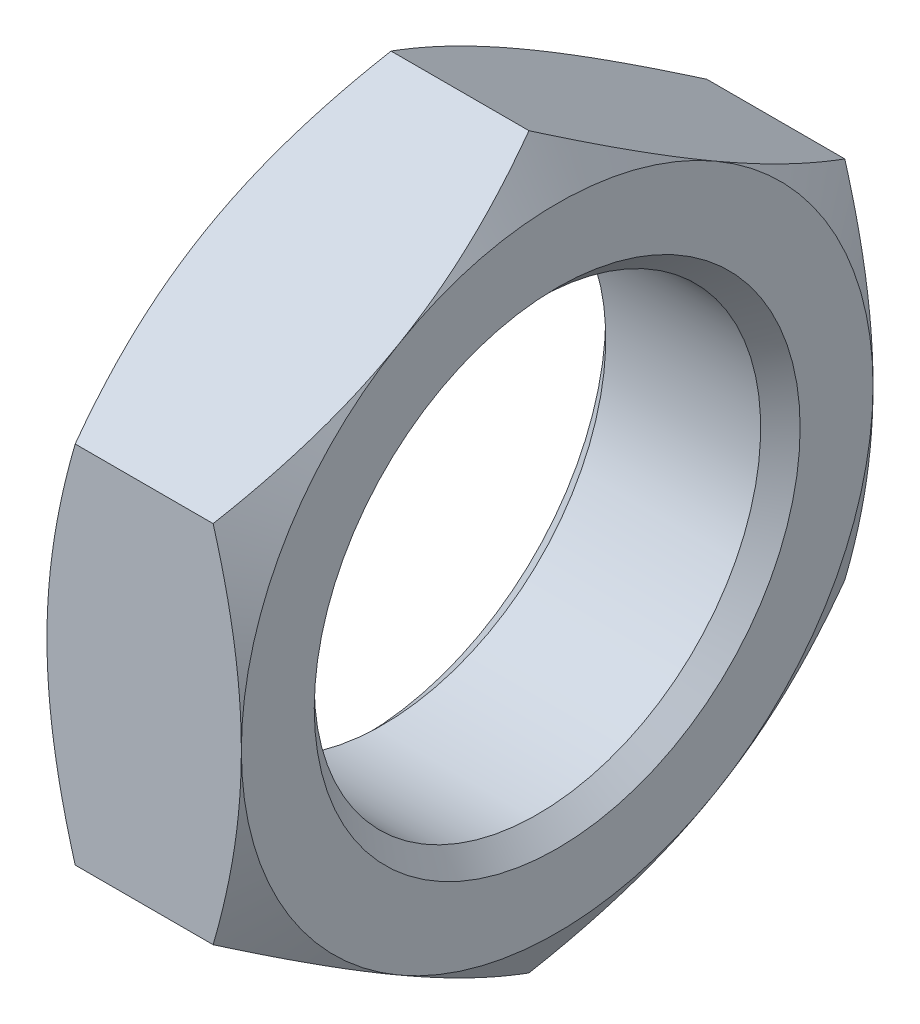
ISO-10303-21;
HEADER;
FILE_DESCRIPTION(('STEP AP214'),'2;1');
FILE_NAME('part.step','',(''),(''),'','','');
FILE_SCHEMA(('AUTOMOTIVE_DESIGN { 1 0 10303 214 1 1 1 1 }'));
ENDSEC;
DATA;
#1=APPLICATION_CONTEXT('core data for automotive mechanical design processes');
#2=APPLICATION_PROTOCOL_DEFINITION('international standard','automotive_design',2000,#1);
#3=PRODUCT_CONTEXT('',#1,'mechanical');
#4=PRODUCT('Part','Part','',(#3));
#5=PRODUCT_RELATED_PRODUCT_CATEGORY('part','',(#4));
#6=PRODUCT_DEFINITION_FORMATION('','',#4);
#7=PRODUCT_DEFINITION_CONTEXT('part definition',#1,'design');
#8=PRODUCT_DEFINITION('design','',#6,#7);
#9=PRODUCT_DEFINITION_SHAPE('','',#8);
#10=(LENGTH_UNIT() NAMED_UNIT(*) SI_UNIT(.MILLI.,.METRE.));
#11=(NAMED_UNIT(*) PLANE_ANGLE_UNIT() SI_UNIT($,.RADIAN.));
#12=(NAMED_UNIT(*) SI_UNIT($,.STERADIAN.) SOLID_ANGLE_UNIT());
#13=UNCERTAINTY_MEASURE_WITH_UNIT(LENGTH_MEASURE(1.E-05),#10,'distance_accuracy_value','');
#14=(GEOMETRIC_REPRESENTATION_CONTEXT(3) GLOBAL_UNCERTAINTY_ASSIGNED_CONTEXT((#13)) GLOBAL_UNIT_ASSIGNED_CONTEXT((#10,
#11,#12)) REPRESENTATION_CONTEXT('',''));
#15=CARTESIAN_POINT('',(0.,0.,0.));
#16=DIRECTION('',(0.,0.,1.));
#17=DIRECTION('',(1.,0.,0.));
#18=AXIS2_PLACEMENT_3D('',#15,#16,#17);
#19=CARTESIAN_POINT('',(1.50111069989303,0.,0.));
#20=DIRECTION('',(1.,0.,0.));
#21=DIRECTION('',(0.,0.,-1.));
#22=AXIS2_PLACEMENT_3D('',#19,#20,#21);
#23=CONICAL_SURFACE('',#22,15.6,1.0471975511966);
#24=CARTESIAN_POINT('',(1.16117983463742,-7.5054380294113,-13.0002));
#25=CARTESIAN_POINT('',(1.06594073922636,-7.6704072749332,-12.7144648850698));
#26=CARTESIAN_POINT('',(0.975023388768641,-7.83601998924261,-12.4276152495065));
#27=CARTESIAN_POINT('',(0.80303347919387,-8.16857343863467,-11.8516157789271));
#28=CARTESIAN_POINT('',(0.721964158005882,-8.33551459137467,-11.5624652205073));
#29=CARTESIAN_POINT('',(0.570760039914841,-8.67104755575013,-10.9813050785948));
#30=CARTESIAN_POINT('',(0.500651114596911,-8.83964230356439,-10.6892904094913));
#31=CARTESIAN_POINT('',(0.372873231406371,-9.17800333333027,-10.1032319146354));
#32=CARTESIAN_POINT('',(0.315203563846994,-9.34776954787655,-9.80918820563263));
#33=CARTESIAN_POINT('',(0.214757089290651,-9.68412343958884,-9.22660617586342));
#34=CARTESIAN_POINT('',(0.171647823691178,-9.85068614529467,-8.93811110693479));
#35=CARTESIAN_POINT('',(0.0993629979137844,-10.184574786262,-8.35979901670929));
#36=CARTESIAN_POINT('',(0.0701877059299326,-10.3519007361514,-8.06998197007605));
#37=CARTESIAN_POINT('',(0.0265074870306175,-10.6868337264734,-7.48986101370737));
#38=CARTESIAN_POINT('',(0.0119851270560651,-10.8544401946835,-7.19955809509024));
#39=CARTESIAN_POINT('',(-0.00207691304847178,-11.1898078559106,-6.6186842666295));
#40=CARTESIAN_POINT('',(-0.00161705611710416,-11.3575690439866,-6.32811336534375));
#41=CARTESIAN_POINT('',(0.0132389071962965,-11.6711983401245,-5.78489148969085));
#42=CARTESIAN_POINT('',(0.025822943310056,-11.8170887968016,-5.53220180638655));
#43=CARTESIAN_POINT('',(0.0620843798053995,-12.1085341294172,-5.02740368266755));
#44=CARTESIAN_POINT('',(0.0857625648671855,-12.2540889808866,-4.77529528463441));
#45=CARTESIAN_POINT('',(0.143799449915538,-12.5447840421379,-4.27179666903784));
#46=CARTESIAN_POINT('',(0.178166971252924,-12.6899238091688,-4.02040721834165));
#47=CARTESIAN_POINT('',(0.256979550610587,-12.9795228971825,-3.51880688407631));
#48=CARTESIAN_POINT('',(0.301425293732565,-13.1239821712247,-3.2685960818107));
#49=CARTESIAN_POINT('',(0.451003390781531,-13.5624963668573,-2.50906721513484));
#50=CARTESIAN_POINT('',(0.571050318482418,-13.8552814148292,-2.00194863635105));
#51=CARTESIAN_POINT('',(0.843507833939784,-14.4364856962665,-0.995273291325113));
#52=CARTESIAN_POINT('',(0.995854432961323,-14.724912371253,-0.495703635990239));
#53=CARTESIAN_POINT('',(1.16117983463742,-15.0112224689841,0.00019999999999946));
#54=B_SPLINE_CURVE_WITH_KNOTS('',3,(#24,#25,#26,#27,#28,#29,#30,#31,#32,#33,#34,#35,#36,#37,#38,
#39,#40,#41,#42,#43,#44,#45,#46,#47,#48,#49,#50,#51,#52,#53),.UNSPECIFIED.,.F.,.F.,(4,2,2,2,2,2,
2,2,2,2,2,2,2,2,4),(0.,1.03025461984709,2.06084706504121,3.09383660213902,4.12676718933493,
5.13420251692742,6.14165723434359,7.14791193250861,8.15413553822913,9.03008081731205,
9.90608806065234,10.7828201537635,11.6596118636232,13.4517531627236,15.240376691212),.UNSPECIFIED.);
#55=CARTESIAN_POINT('',(0.,-11.2583302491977,-6.5));
#56=VERTEX_POINT('',#55);
#57=CARTESIAN_POINT('',(1.16111316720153,-15.0111069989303,0.));
#58=VERTEX_POINT('',#57);
#59=EDGE_CURVE('E274',#56,#58,#54,.T.);
#60=ORIENTED_EDGE('',*,*,#59,.T.);
#61=CARTESIAN_POINT('',(1.16117983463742,-15.0112224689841,-0.000199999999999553));
#62=CARTESIAN_POINT('',(1.06594073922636,-14.8462532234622,0.285535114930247));
#63=CARTESIAN_POINT('',(0.975023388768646,-14.6806405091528,0.572384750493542));
#64=CARTESIAN_POINT('',(0.803033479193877,-14.3480870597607,1.14838422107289));
#65=CARTESIAN_POINT('',(0.72196415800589,-14.1811459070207,1.43753477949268));
#66=CARTESIAN_POINT('',(0.570760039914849,-13.8456129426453,2.01869492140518));
#67=CARTESIAN_POINT('',(0.500651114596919,-13.677018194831,2.31070959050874));
#68=CARTESIAN_POINT('',(0.37287323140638,-13.3386571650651,2.89676808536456));
#69=CARTESIAN_POINT('',(0.315203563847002,-13.1688909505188,3.19081179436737));
#70=CARTESIAN_POINT('',(0.21475708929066,-12.8325370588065,3.77339382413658));
#71=CARTESIAN_POINT('',(0.171647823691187,-12.6659743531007,4.06188889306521));
#72=CARTESIAN_POINT('',(0.0993629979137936,-12.3320857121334,4.64020098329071));
#73=CARTESIAN_POINT('',(0.0701877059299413,-12.164759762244,4.93001802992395));
#74=CARTESIAN_POINT('',(0.0265074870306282,-11.829826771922,5.51013898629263));
#75=CARTESIAN_POINT('',(0.0119851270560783,-11.6622203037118,5.80044190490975));
#76=CARTESIAN_POINT('',(-0.00207691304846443,-11.3268526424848,6.3813157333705));
#77=CARTESIAN_POINT('',(-0.00161705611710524,-11.1590914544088,6.67188663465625));
#78=CARTESIAN_POINT('',(0.0132389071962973,-10.8454621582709,7.21510851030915));
#79=CARTESIAN_POINT('',(0.0258229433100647,-10.6995717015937,7.46779819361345));
#80=CARTESIAN_POINT('',(0.0620843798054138,-10.4081263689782,7.97259631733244));
#81=CARTESIAN_POINT('',(0.0857625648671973,-10.2625715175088,8.22470471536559));
#82=CARTESIAN_POINT('',(0.143799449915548,-9.97187645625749,8.72820333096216));
#83=CARTESIAN_POINT('',(0.178166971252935,-9.82673668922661,8.97959278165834));
#84=CARTESIAN_POINT('',(0.256979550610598,-9.5371376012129,9.48119311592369));
#85=CARTESIAN_POINT('',(0.301425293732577,-9.3926783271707,9.73140391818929));
#86=CARTESIAN_POINT('',(0.451003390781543,-8.9541641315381,10.4909327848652));
#87=CARTESIAN_POINT('',(0.571050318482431,-8.66137908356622,10.998051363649));
#88=CARTESIAN_POINT('',(0.843507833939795,-8.08017480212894,12.0047267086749));
#89=CARTESIAN_POINT('',(0.99585443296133,-7.79174812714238,12.5042963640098));
#90=CARTESIAN_POINT('',(1.16117983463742,-7.5054380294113,13.0002));
#91=B_SPLINE_CURVE_WITH_KNOTS('',3,(#61,#62,#63,#64,#65,#66,#67,#68,#69,#70,#71,#72,#73,#74,#75,
#76,#77,#78,#79,#80,#81,#82,#83,#84,#85,#86,#87,#88,#89,#90),.UNSPECIFIED.,.F.,.F.,(4,2,2,2,2,2,
2,2,2,2,2,2,2,2,4),(0.,1.03025461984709,2.0608470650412,3.09383660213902,4.12676718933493,
5.13420251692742,6.14165723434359,7.14791193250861,8.15413553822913,9.03008081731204,
9.90608806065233,10.7828201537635,11.6596118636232,13.4517531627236,15.240376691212),.UNSPECIFIED.);
#92=CARTESIAN_POINT('',(0.,-11.2583302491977,6.5));
#93=VERTEX_POINT('',#92);
#94=EDGE_CURVE('E222',#58,#93,#91,.T.);
#95=ORIENTED_EDGE('',*,*,#94,.T.);
#96=CARTESIAN_POINT('',(0.,0.,0.));
#97=DIRECTION('',(-1.,0.,0.));
#98=DIRECTION('',(0.,0.,1.));
#99=AXIS2_PLACEMENT_3D('',#96,#97,#98);
#100=CIRCLE('',#99,13.);
#101=EDGE_CURVE('E252',#56,#93,#100,.T.);
#102=ORIENTED_EDGE('',*,*,#101,.F.);
#103=EDGE_LOOP('',(#60,#95,#102));
#104=FACE_BOUND('',#103,.T.);
#105=ADVANCED_FACE('F16',(#104),#23,.T.);
#106=CARTESIAN_POINT('',(0.,0.,13.));
#107=VERTEX_POINT('',#106);
#108=EDGE_CURVE('E25',#93,#107,#100,.T.);
#109=ORIENTED_EDGE('',*,*,#108,.F.);
#110=CARTESIAN_POINT('',(1.16111316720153,-7.50555349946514,13.));
#111=VERTEX_POINT('',#110);
#112=EDGE_CURVE('E223',#93,#111,#91,.T.);
#113=ORIENTED_EDGE('',*,*,#112,.T.);
#114=CARTESIAN_POINT('',(6.24367003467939,-19.9530309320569,13.));
#115=CARTESIAN_POINT('',(6.10675951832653,-19.6699984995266,13.));
#116=CARTESIAN_POINT('',(5.97054766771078,-19.3866282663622,13.));
#117=CARTESIAN_POINT('',(5.69967996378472,-18.819141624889,13.));
#118=CARTESIAN_POINT('',(5.56502412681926,-18.5350252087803,13.));
#119=CARTESIAN_POINT('',(5.16359177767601,-17.6813722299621,13.));
#120=CARTESIAN_POINT('',(4.89939263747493,-17.1106189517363,13.));
#121=CARTESIAN_POINT('',(4.37803777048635,-15.9620155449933,13.));
#122=CARTESIAN_POINT('',(4.12093009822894,-15.3841435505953,13.));
#123=CARTESIAN_POINT('',(3.61751387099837,-14.223730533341,13.));
#124=CARTESIAN_POINT('',(3.37120479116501,-13.6411897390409,13.));
#125=CARTESIAN_POINT('',(2.884892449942,-12.4525278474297,13.));
#126=CARTESIAN_POINT('',(2.64531468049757,-11.8462317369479,13.));
#127=CARTESIAN_POINT('',(2.18479905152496,-10.626465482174,13.));
#128=CARTESIAN_POINT('',(1.96386331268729,-10.0129945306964,13.));
#129=CARTESIAN_POINT('',(1.54658767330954,-8.77914030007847,13.));
#130=CARTESIAN_POINT('',(1.35019612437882,-8.158774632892,13.));
#131=CARTESIAN_POINT('',(0.988437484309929,-6.90908844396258,13.));
#132=CARTESIAN_POINT('',(0.823060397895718,-6.2797708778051,13.));
#133=CARTESIAN_POINT('',(0.604789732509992,-5.33071748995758,13.));
#134=CARTESIAN_POINT('',(0.53713702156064,-5.01435400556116,13.));
#135=CARTESIAN_POINT('',(0.412589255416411,-4.37950550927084,13.));
#136=CARTESIAN_POINT('',(0.355693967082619,-4.06102054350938,13.));
#137=CARTESIAN_POINT('',(0.253677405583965,-3.42216285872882,13.));
#138=CARTESIAN_POINT('',(0.208556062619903,-3.1017901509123,13.));
#139=CARTESIAN_POINT('',(0.13099500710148,-2.45951450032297,13.));
#140=CARTESIAN_POINT('',(0.0985548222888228,-2.1376116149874,13.));
#141=CARTESIAN_POINT('',(0.0473958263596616,-1.49683558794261,13.));
#142=CARTESIAN_POINT('',(0.0285075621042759,-1.17797605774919,13.));
#143=CARTESIAN_POINT('',(0.00421658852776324,-0.539745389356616,13.));
#144=CARTESIAN_POINT('',(-0.00118633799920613,-0.220374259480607,13.));
#145=CARTESIAN_POINT('',(0.00162133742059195,0.418312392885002,13.));
#146=CARTESIAN_POINT('',(0.00983206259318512,0.737627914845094,13.));
#147=CARTESIAN_POINT('',(0.0396705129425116,1.37563550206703,13.));
#148=CARTESIAN_POINT('',(0.0612988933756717,1.69432753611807,13.));
#149=CARTESIAN_POINT('',(0.129522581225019,2.46666381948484,13.));
#150=CARTESIAN_POINT('',(0.18284007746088,2.91972422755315,13.));
#151=CARTESIAN_POINT('',(0.313637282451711,3.8223465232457,13.));
#152=CARTESIAN_POINT('',(0.391120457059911,4.27190789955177,13.));
#153=CARTESIAN_POINT('',(0.56749215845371,5.16715105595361,13.));
#154=CARTESIAN_POINT('',(0.666398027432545,5.61282938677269,13.));
#155=CARTESIAN_POINT('',(0.882609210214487,6.49964973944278,13.));
#156=CARTESIAN_POINT('',(0.999914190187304,6.94079184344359,13.));
#157=CARTESIAN_POINT('',(1.25281090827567,7.82808644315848,13.));
#158=CARTESIAN_POINT('',(1.38874298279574,8.27414126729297,13.));
#159=CARTESIAN_POINT('',(1.6742012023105,9.16185536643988,13.));
#160=CARTESIAN_POINT('',(1.82372743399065,9.60351461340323,13.));
#161=CARTESIAN_POINT('',(2.13403960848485,10.4826634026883,13.));
#162=CARTESIAN_POINT('',(2.29482150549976,10.9201543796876,13.));
#163=CARTESIAN_POINT('',(2.62579789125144,11.7915419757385,13.));
#164=CARTESIAN_POINT('',(2.79599229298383,12.2254386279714,13.));
#165=CARTESIAN_POINT('',(3.19272444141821,13.2104671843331,13.));
#166=CARTESIAN_POINT('',(3.42175285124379,13.7605941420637,13.));
#167=CARTESIAN_POINT('',(3.89005160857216,14.856483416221,13.));
#168=CARTESIAN_POINT('',(4.12932246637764,15.4022455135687,13.));
#169=CARTESIAN_POINT('',(4.61615654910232,16.4901695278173,13.));
#170=CARTESIAN_POINT('',(4.86372128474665,17.0323307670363,13.));
#171=CARTESIAN_POINT('',(5.36555618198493,18.1135228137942,13.));
#172=CARTESIAN_POINT('',(5.61982622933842,18.6525536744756,13.));
#173=CARTESIAN_POINT('',(6.13412047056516,19.7284871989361,13.));
#174=CARTESIAN_POINT('',(6.39414989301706,20.2653873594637,13.));
#175=CARTESIAN_POINT('',(6.91878563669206,21.3369461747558,13.));
#176=CARTESIAN_POINT('',(7.18339197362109,21.8716048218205,13.));
#177=CARTESIAN_POINT('',(7.71640252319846,22.9389529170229,13.));
#178=CARTESIAN_POINT('',(7.98480632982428,23.4716425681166,13.));
#179=CARTESIAN_POINT('',(8.52484428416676,24.5353827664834,13.));
#180=CARTESIAN_POINT('',(8.7964784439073,25.0664333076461,13.));
#181=CARTESIAN_POINT('',(9.57296546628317,26.5748797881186,13.));
#182=CARTESIAN_POINT('',(10.0811007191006,27.5505861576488,13.));
#183=CARTESIAN_POINT('',(11.1043856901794,29.4983412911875,13.));
#184=CARTESIAN_POINT('',(11.6195356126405,30.4703899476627,13.));
#185=CARTESIAN_POINT('',(12.6541114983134,32.4094614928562,13.));
#186=CARTESIAN_POINT('',(13.1735255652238,33.376490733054,13.));
#187=CARTESIAN_POINT('',(13.9558199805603,34.8252888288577,13.));
#188=CARTESIAN_POINT('',(14.2171074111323,35.3079190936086,13.));
#189=CARTESIAN_POINT('',(14.7406361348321,36.2726610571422,13.));
#190=CARTESIAN_POINT('',(15.0028774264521,36.754772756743,13.));
#191=CARTESIAN_POINT('',(15.265542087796,37.2366537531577,13.));
#192=B_SPLINE_CURVE_WITH_KNOTS('',3,(#114,#115,#116,#117,#118,#119,#120,#121,#122,#123,#124,
#125,#126,#127,#128,#129,#130,#131,#132,#133,#134,#135,#136,#137,#138,#139,#140,#141,#142,#143,
#144,#145,#146,#147,#148,#149,#150,#151,#152,#153,#154,#155,#156,#157,#158,#159,#160,#161,#162,
#163,#164,#165,#166,#167,#168,#169,#170,#171,#172,#173,#174,#175,#176,#177,#178,#179,#180,#181,
#182,#183,#184,#185,#186,#187,#188,#189,#190,#191),.UNSPECIFIED.,.F.,.F.,(4,2,2,2,2,2,2,2,2,2,2,
2,2,2,2,2,2,2,2,2,2,2,2,2,2,2,2,2,2,2,2,2,2,2,2,2,2,2,4),(0.,0.943219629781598,1.88644915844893,
3.7731983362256,5.6705747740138,7.56785888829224,9.52336832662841,11.4790999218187,
13.4306441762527,15.3815584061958,16.3519537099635,17.3223279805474,18.2926964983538,
19.2630288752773,20.2210061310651,21.1789679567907,22.1369384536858,23.0949557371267,
24.4627548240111,25.8307501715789,27.1998571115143,28.5689392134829,29.9676009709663,
31.3662716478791,32.7644421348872,34.1625997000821,35.9501549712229,37.7377994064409,
39.5257712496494,41.3137126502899,43.1033497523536,44.8929929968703,46.682446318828,
48.4719063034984,51.7721421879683,55.0724743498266,58.3655479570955,60.0120063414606,
61.6584621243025),.UNSPECIFIED.);
#193=EDGE_CURVE('E232',#111,#107,#192,.T.);
#194=ORIENTED_EDGE('',*,*,#193,.T.);
#195=EDGE_LOOP('',(#109,#113,#194));
#196=FACE_BOUND('',#195,.T.);
#197=ADVANCED_FACE('F310',(#196),#23,.T.);
#198=CARTESIAN_POINT('',(0.,11.2583302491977,6.5));
#199=VERTEX_POINT('',#198);
#200=EDGE_CURVE('E11',#107,#199,#100,.T.);
#201=ORIENTED_EDGE('',*,*,#200,.F.);
#202=CARTESIAN_POINT('',(1.16111316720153,7.50555349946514,13.));
#203=VERTEX_POINT('',#202);
#204=EDGE_CURVE('E135',#107,#203,#192,.T.);
#205=ORIENTED_EDGE('',*,*,#204,.T.);
#206=CARTESIAN_POINT('',(1.16117983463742,7.5054380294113,13.0002));
#207=CARTESIAN_POINT('',(1.06594073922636,7.6704072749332,12.7144648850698));
#208=CARTESIAN_POINT('',(0.975023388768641,7.83601998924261,12.4276152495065));
#209=CARTESIAN_POINT('',(0.80303347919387,8.16857343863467,11.8516157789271));
#210=CARTESIAN_POINT('',(0.721964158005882,8.33551459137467,11.5624652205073));
#211=CARTESIAN_POINT('',(0.570760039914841,8.67104755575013,10.9813050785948));
#212=CARTESIAN_POINT('',(0.500651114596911,8.83964230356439,10.6892904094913));
#213=CARTESIAN_POINT('',(0.372873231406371,9.17800333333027,10.1032319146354));
#214=CARTESIAN_POINT('',(0.315203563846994,9.34776954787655,9.80918820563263));
#215=CARTESIAN_POINT('',(0.214757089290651,9.68412343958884,9.22660617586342));
#216=CARTESIAN_POINT('',(0.171647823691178,9.85068614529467,8.93811110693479));
#217=CARTESIAN_POINT('',(0.0993629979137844,10.184574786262,8.35979901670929));
#218=CARTESIAN_POINT('',(0.0701877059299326,10.3519007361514,8.06998197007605));
#219=CARTESIAN_POINT('',(0.0265074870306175,10.6868337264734,7.48986101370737));
#220=CARTESIAN_POINT('',(0.0119851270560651,10.8544401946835,7.19955809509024));
#221=CARTESIAN_POINT('',(-0.00207691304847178,11.1898078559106,6.6186842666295));
#222=CARTESIAN_POINT('',(-0.00161705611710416,11.3575690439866,6.32811336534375));
#223=CARTESIAN_POINT('',(0.0132389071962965,11.6711983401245,5.78489148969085));
#224=CARTESIAN_POINT('',(0.025822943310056,11.8170887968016,5.53220180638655));
#225=CARTESIAN_POINT('',(0.0620843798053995,12.1085341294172,5.02740368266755));
#226=CARTESIAN_POINT('',(0.0857625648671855,12.2540889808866,4.77529528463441));
#227=CARTESIAN_POINT('',(0.143799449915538,12.5447840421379,4.27179666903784));
#228=CARTESIAN_POINT('',(0.178166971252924,12.6899238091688,4.02040721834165));
#229=CARTESIAN_POINT('',(0.256979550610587,12.9795228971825,3.51880688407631));
#230=CARTESIAN_POINT('',(0.301425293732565,13.1239821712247,3.2685960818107));
#231=CARTESIAN_POINT('',(0.451003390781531,13.5624963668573,2.50906721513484));
#232=CARTESIAN_POINT('',(0.571050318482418,13.8552814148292,2.00194863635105));
#233=CARTESIAN_POINT('',(0.843507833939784,14.4364856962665,0.995273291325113));
#234=CARTESIAN_POINT('',(0.995854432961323,14.724912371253,0.495703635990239));
#235=CARTESIAN_POINT('',(1.16117983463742,15.0112224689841,-0.00019999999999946));
#236=B_SPLINE_CURVE_WITH_KNOTS('',3,(#206,#207,#208,#209,#210,#211,#212,#213,#214,#215,#216,
#217,#218,#219,#220,#221,#222,#223,#224,#225,#226,#227,#228,#229,#230,#231,#232,#233,#234,#235),
.UNSPECIFIED.,.F.,.F.,(4,2,2,2,2,2,2,2,2,2,2,2,2,2,4),(0.,1.03025461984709,2.06084706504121,
3.09383660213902,4.12676718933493,5.13420251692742,6.14165723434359,7.14791193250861,
8.15413553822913,9.03008081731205,9.90608806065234,10.7828201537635,11.6596118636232,
13.4517531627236,15.240376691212),.UNSPECIFIED.);
#237=EDGE_CURVE('E136',#203,#199,#236,.T.);
#238=ORIENTED_EDGE('',*,*,#237,.T.);
#239=EDGE_LOOP('',(#201,#205,#238));
#240=FACE_BOUND('',#239,.T.);
#241=ADVANCED_FACE('F134',(#240),#23,.T.);
#242=CARTESIAN_POINT('',(6.24367003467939,-19.9530309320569,-13.));
#243=CARTESIAN_POINT('',(6.10675951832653,-19.6699984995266,-13.));
#244=CARTESIAN_POINT('',(5.97054766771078,-19.3866282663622,-13.));
#245=CARTESIAN_POINT('',(5.69967996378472,-18.819141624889,-13.));
#246=CARTESIAN_POINT('',(5.56502412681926,-18.5350252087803,-13.));
#247=CARTESIAN_POINT('',(5.16359177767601,-17.6813722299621,-13.));
#248=CARTESIAN_POINT('',(4.89939263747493,-17.1106189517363,-13.));
#249=CARTESIAN_POINT('',(4.37803777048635,-15.9620155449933,-13.));
#250=CARTESIAN_POINT('',(4.12093009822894,-15.3841435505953,-13.));
#251=CARTESIAN_POINT('',(3.61751387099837,-14.223730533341,-13.));
#252=CARTESIAN_POINT('',(3.37120479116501,-13.6411897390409,-13.));
#253=CARTESIAN_POINT('',(2.884892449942,-12.4525278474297,-13.));
#254=CARTESIAN_POINT('',(2.64531468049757,-11.8462317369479,-13.));
#255=CARTESIAN_POINT('',(2.18479905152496,-10.626465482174,-13.));
#256=CARTESIAN_POINT('',(1.96386331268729,-10.0129945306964,-13.));
#257=CARTESIAN_POINT('',(1.54658767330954,-8.77914030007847,-13.));
#258=CARTESIAN_POINT('',(1.35019612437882,-8.158774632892,-13.));
#259=CARTESIAN_POINT('',(0.988437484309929,-6.90908844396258,-13.));
#260=CARTESIAN_POINT('',(0.823060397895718,-6.2797708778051,-13.));
#261=CARTESIAN_POINT('',(0.604789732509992,-5.33071748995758,-13.));
#262=CARTESIAN_POINT('',(0.53713702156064,-5.01435400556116,-13.));
#263=CARTESIAN_POINT('',(0.412589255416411,-4.37950550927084,-13.));
#264=CARTESIAN_POINT('',(0.355693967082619,-4.06102054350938,-13.));
#265=CARTESIAN_POINT('',(0.253677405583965,-3.42216285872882,-13.));
#266=CARTESIAN_POINT('',(0.208556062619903,-3.1017901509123,-13.));
#267=CARTESIAN_POINT('',(0.13099500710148,-2.45951450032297,-13.));
#268=CARTESIAN_POINT('',(0.0985548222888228,-2.1376116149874,-13.));
#269=CARTESIAN_POINT('',(0.0473958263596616,-1.49683558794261,-13.));
#270=CARTESIAN_POINT('',(0.0285075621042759,-1.17797605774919,-13.));
#271=CARTESIAN_POINT('',(0.00421658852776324,-0.539745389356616,-13.));
#272=CARTESIAN_POINT('',(-0.00118633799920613,-0.220374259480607,-13.));
#273=CARTESIAN_POINT('',(0.00162133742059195,0.418312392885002,-13.));
#274=CARTESIAN_POINT('',(0.00983206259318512,0.737627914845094,-13.));
#275=CARTESIAN_POINT('',(0.0396705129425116,1.37563550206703,-13.));
#276=CARTESIAN_POINT('',(0.0612988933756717,1.69432753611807,-13.));
#277=CARTESIAN_POINT('',(0.129522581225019,2.46666381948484,-13.));
#278=CARTESIAN_POINT('',(0.18284007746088,2.91972422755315,-13.));
#279=CARTESIAN_POINT('',(0.313637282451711,3.8223465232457,-13.));
#280=CARTESIAN_POINT('',(0.391120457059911,4.27190789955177,-13.));
#281=CARTESIAN_POINT('',(0.56749215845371,5.16715105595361,-13.));
#282=CARTESIAN_POINT('',(0.666398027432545,5.61282938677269,-13.));
#283=CARTESIAN_POINT('',(0.882609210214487,6.49964973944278,-13.));
#284=CARTESIAN_POINT('',(0.999914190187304,6.94079184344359,-13.));
#285=CARTESIAN_POINT('',(1.25281090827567,7.82808644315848,-13.));
#286=CARTESIAN_POINT('',(1.38874298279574,8.27414126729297,-13.));
#287=CARTESIAN_POINT('',(1.6742012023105,9.16185536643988,-13.));
#288=CARTESIAN_POINT('',(1.82372743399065,9.60351461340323,-13.));
#289=CARTESIAN_POINT('',(2.13403960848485,10.4826634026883,-13.));
#290=CARTESIAN_POINT('',(2.29482150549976,10.9201543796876,-13.));
#291=CARTESIAN_POINT('',(2.62579789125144,11.7915419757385,-13.));
#292=CARTESIAN_POINT('',(2.79599229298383,12.2254386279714,-13.));
#293=CARTESIAN_POINT('',(3.19272444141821,13.2104671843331,-13.));
#294=CARTESIAN_POINT('',(3.42175285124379,13.7605941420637,-13.));
#295=CARTESIAN_POINT('',(3.89005160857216,14.856483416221,-13.));
#296=CARTESIAN_POINT('',(4.12932246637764,15.4022455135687,-13.));
#297=CARTESIAN_POINT('',(4.61615654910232,16.4901695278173,-13.));
#298=CARTESIAN_POINT('',(4.86372128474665,17.0323307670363,-13.));
#299=CARTESIAN_POINT('',(5.36555618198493,18.1135228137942,-13.));
#300=CARTESIAN_POINT('',(5.61982622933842,18.6525536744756,-13.));
#301=CARTESIAN_POINT('',(6.13412047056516,19.7284871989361,-13.));
#302=CARTESIAN_POINT('',(6.39414989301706,20.2653873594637,-13.));
#303=CARTESIAN_POINT('',(6.91878563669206,21.3369461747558,-13.));
#304=CARTESIAN_POINT('',(7.18339197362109,21.8716048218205,-13.));
#305=CARTESIAN_POINT('',(7.71640252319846,22.9389529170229,-13.));
#306=CARTESIAN_POINT('',(7.98480632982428,23.4716425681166,-13.));
#307=CARTESIAN_POINT('',(8.52484428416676,24.5353827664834,-13.));
#308=CARTESIAN_POINT('',(8.7964784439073,25.0664333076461,-13.));
#309=CARTESIAN_POINT('',(9.57296546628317,26.5748797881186,-13.));
#310=CARTESIAN_POINT('',(10.0811007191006,27.5505861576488,-13.));
#311=CARTESIAN_POINT('',(11.1043856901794,29.4983412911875,-13.));
#312=CARTESIAN_POINT('',(11.6195356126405,30.4703899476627,-13.));
#313=CARTESIAN_POINT('',(12.6541114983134,32.4094614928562,-13.));
#314=CARTESIAN_POINT('',(13.1735255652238,33.376490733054,-13.));
#315=CARTESIAN_POINT('',(13.9558199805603,34.8252888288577,-13.));
#316=CARTESIAN_POINT('',(14.2171074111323,35.3079190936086,-13.));
#317=CARTESIAN_POINT('',(14.7406361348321,36.2726610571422,-13.));
#318=CARTESIAN_POINT('',(15.0028774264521,36.754772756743,-13.));
#319=CARTESIAN_POINT('',(15.265542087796,37.2366537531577,-13.));
#320=B_SPLINE_CURVE_WITH_KNOTS('',3,(#242,#243,#244,#245,#246,#247,#248,#249,#250,#251,#252,
#253,#254,#255,#256,#257,#258,#259,#260,#261,#262,#263,#264,#265,#266,#267,#268,#269,#270,#271,
#272,#273,#274,#275,#276,#277,#278,#279,#280,#281,#282,#283,#284,#285,#286,#287,#288,#289,#290,
#291,#292,#293,#294,#295,#296,#297,#298,#299,#300,#301,#302,#303,#304,#305,#306,#307,#308,#309,
#310,#311,#312,#313,#314,#315,#316,#317,#318,#319),.UNSPECIFIED.,.F.,.F.,(4,2,2,2,2,2,2,2,2,2,2,
2,2,2,2,2,2,2,2,2,2,2,2,2,2,2,2,2,2,2,2,2,2,2,2,2,2,2,4),(0.,0.943219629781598,1.88644915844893,
3.7731983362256,5.6705747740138,7.56785888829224,9.52336832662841,11.4790999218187,
13.4306441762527,15.3815584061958,16.3519537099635,17.3223279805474,18.2926964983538,
19.2630288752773,20.2210061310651,21.1789679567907,22.1369384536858,23.0949557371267,
24.4627548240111,25.8307501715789,27.1998571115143,28.5689392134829,29.9676009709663,
31.3662716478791,32.7644421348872,34.1625997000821,35.9501549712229,37.7377994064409,
39.5257712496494,41.3137126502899,43.1033497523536,44.8929929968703,46.682446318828,
48.4719063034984,51.7721421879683,55.0724743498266,58.3655479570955,60.0120063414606,
61.6584621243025),.UNSPECIFIED.);
#321=CARTESIAN_POINT('',(0.,0.,-13.));
#322=VERTEX_POINT('',#321);
#323=CARTESIAN_POINT('',(1.16111316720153,-7.50555349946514,-13.));
#324=VERTEX_POINT('',#323);
#325=EDGE_CURVE('E277',#322,#324,#320,.F.);
#326=ORIENTED_EDGE('',*,*,#325,.T.);
#327=EDGE_CURVE('E276',#324,#56,#54,.T.);
#328=ORIENTED_EDGE('',*,*,#327,.T.);
#329=EDGE_CURVE('E126',#322,#56,#100,.T.);
#330=ORIENTED_EDGE('',*,*,#329,.F.);
#331=EDGE_LOOP('',(#326,#328,#330));
#332=FACE_BOUND('',#331,.T.);
#333=ADVANCED_FACE('F324',(#332),#23,.T.);
#334=CARTESIAN_POINT('',(0.,11.2583302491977,-6.5));
#335=VERTEX_POINT('',#334);
#336=EDGE_CURVE('E24',#199,#335,#100,.T.);
#337=ORIENTED_EDGE('',*,*,#336,.F.);
#338=CARTESIAN_POINT('',(1.16111316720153,15.0111069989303,0.));
#339=VERTEX_POINT('',#338);
#340=EDGE_CURVE('E117',#199,#339,#236,.T.);
#341=ORIENTED_EDGE('',*,*,#340,.T.);
#342=CARTESIAN_POINT('',(1.16117983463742,15.0112224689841,0.000199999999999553));
#343=CARTESIAN_POINT('',(1.06594073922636,14.8462532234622,-0.285535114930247));
#344=CARTESIAN_POINT('',(0.975023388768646,14.6806405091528,-0.572384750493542));
#345=CARTESIAN_POINT('',(0.803033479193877,14.3480870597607,-1.14838422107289));
#346=CARTESIAN_POINT('',(0.72196415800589,14.1811459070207,-1.43753477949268));
#347=CARTESIAN_POINT('',(0.570760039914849,13.8456129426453,-2.01869492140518));
#348=CARTESIAN_POINT('',(0.500651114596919,13.677018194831,-2.31070959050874));
#349=CARTESIAN_POINT('',(0.37287323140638,13.3386571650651,-2.89676808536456));
#350=CARTESIAN_POINT('',(0.315203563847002,13.1688909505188,-3.19081179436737));
#351=CARTESIAN_POINT('',(0.21475708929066,12.8325370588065,-3.77339382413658));
#352=CARTESIAN_POINT('',(0.171647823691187,12.6659743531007,-4.06188889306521));
#353=CARTESIAN_POINT('',(0.0993629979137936,12.3320857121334,-4.64020098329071));
#354=CARTESIAN_POINT('',(0.0701877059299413,12.164759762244,-4.93001802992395));
#355=CARTESIAN_POINT('',(0.0265074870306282,11.829826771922,-5.51013898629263));
#356=CARTESIAN_POINT('',(0.0119851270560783,11.6622203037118,-5.80044190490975));
#357=CARTESIAN_POINT('',(-0.00207691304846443,11.3268526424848,-6.3813157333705));
#358=CARTESIAN_POINT('',(-0.00161705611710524,11.1590914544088,-6.67188663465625));
#359=CARTESIAN_POINT('',(0.0132389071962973,10.8454621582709,-7.21510851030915));
#360=CARTESIAN_POINT('',(0.0258229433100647,10.6995717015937,-7.46779819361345));
#361=CARTESIAN_POINT('',(0.0620843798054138,10.4081263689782,-7.97259631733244));
#362=CARTESIAN_POINT('',(0.0857625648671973,10.2625715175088,-8.22470471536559));
#363=CARTESIAN_POINT('',(0.143799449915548,9.97187645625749,-8.72820333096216));
#364=CARTESIAN_POINT('',(0.178166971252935,9.82673668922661,-8.97959278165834));
#365=CARTESIAN_POINT('',(0.256979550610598,9.5371376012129,-9.48119311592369));
#366=CARTESIAN_POINT('',(0.301425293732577,9.3926783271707,-9.73140391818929));
#367=CARTESIAN_POINT('',(0.451003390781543,8.9541641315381,-10.4909327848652));
#368=CARTESIAN_POINT('',(0.571050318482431,8.66137908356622,-10.998051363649));
#369=CARTESIAN_POINT('',(0.843507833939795,8.08017480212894,-12.0047267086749));
#370=CARTESIAN_POINT('',(0.99585443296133,7.79174812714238,-12.5042963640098));
#371=CARTESIAN_POINT('',(1.16117983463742,7.5054380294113,-13.0002));
#372=B_SPLINE_CURVE_WITH_KNOTS('',3,(#342,#343,#344,#345,#346,#347,#348,#349,#350,#351,#352,
#353,#354,#355,#356,#357,#358,#359,#360,#361,#362,#363,#364,#365,#366,#367,#368,#369,#370,#371),
.UNSPECIFIED.,.F.,.F.,(4,2,2,2,2,2,2,2,2,2,2,2,2,2,4),(0.,1.03025461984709,2.0608470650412,
3.09383660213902,4.12676718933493,5.13420251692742,6.14165723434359,7.14791193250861,
8.15413553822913,9.03008081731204,9.90608806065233,10.7828201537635,11.6596118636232,
13.4517531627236,15.240376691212),.UNSPECIFIED.);
#373=EDGE_CURVE('E106',#339,#335,#372,.T.);
#374=ORIENTED_EDGE('',*,*,#373,.T.);
#375=EDGE_LOOP('',(#337,#341,#374));
#376=FACE_BOUND('',#375,.T.);
#377=ADVANCED_FACE('F115',(#376),#23,.T.);
#378=CARTESIAN_POINT('',(0.,0.,0.));
#379=DIRECTION('',(1.,0.,0.));
#380=DIRECTION('',(0.,0.,-1.));
#381=AXIS2_PLACEMENT_3D('',#378,#379,#380);
#382=PLANE('',#381);
#383=CARTESIAN_POINT('',(0.,0.,0.));
#384=DIRECTION('',(-1.,0.,0.));
#385=DIRECTION('',(0.,0.,1.));
#386=AXIS2_PLACEMENT_3D('',#383,#384,#385);
#387=CIRCLE('',#386,10.);
#388=CARTESIAN_POINT('',(0.,0.,10.));
#389=VERTEX_POINT('',#388);
#390=EDGE_CURVE('E401',#389,#389,#387,.T.);
#391=ORIENTED_EDGE('',*,*,#390,.F.);
#392=EDGE_LOOP('',(#391));
#393=FACE_BOUND('',#392,.T.);
#394=ORIENTED_EDGE('',*,*,#200,.T.);
#395=ORIENTED_EDGE('',*,*,#336,.T.);
#396=EDGE_CURVE('E120',#335,#322,#100,.T.);
#397=ORIENTED_EDGE('',*,*,#396,.T.);
#398=ORIENTED_EDGE('',*,*,#329,.T.);
#399=ORIENTED_EDGE('',*,*,#101,.T.);
#400=ORIENTED_EDGE('',*,*,#108,.T.);
#401=EDGE_LOOP('',(#394,#395,#397,#398,#399,#400));
#402=FACE_BOUND('',#401,.T.);
#403=ADVANCED_FACE('F18',(#393,#402),#382,.F.);
#404=CARTESIAN_POINT('',(1.16111316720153,7.50555349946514,-13.));
#405=VERTEX_POINT('',#404);
#406=EDGE_CURVE('E103',#335,#405,#372,.T.);
#407=ORIENTED_EDGE('',*,*,#406,.T.);
#408=EDGE_CURVE('E122',#405,#322,#320,.F.);
#409=ORIENTED_EDGE('',*,*,#408,.T.);
#410=ORIENTED_EDGE('',*,*,#396,.F.);
#411=EDGE_LOOP('',(#407,#409,#410));
#412=FACE_BOUND('',#411,.T.);
#413=ADVANCED_FACE('F121',(#412),#23,.T.);
#414=CARTESIAN_POINT('',(8.,15.0111069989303,0.));
#415=DIRECTION('',(0.,-0.866025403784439,-0.5));
#416=DIRECTION('',(0.,0.5,-0.866025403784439));
#417=AXIS2_PLACEMENT_3D('',#414,#415,#416);
#418=PLANE('',#417);
#419=DIRECTION('',(-1.,0.,0.));
#420=VECTOR('',#419,1.);
#421=CARTESIAN_POINT('',(8.,7.50555349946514,13.));
#422=LINE('',#421,#420);
#423=CARTESIAN_POINT('',(6.83888683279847,7.50555349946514,13.));
#424=VERTEX_POINT('',#423);
#425=EDGE_CURVE('E347',#424,#203,#422,.T.);
#426=ORIENTED_EDGE('',*,*,#425,.F.);
#427=CARTESIAN_POINT('',(6.83882016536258,15.0112224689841,-0.000200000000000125));
#428=CARTESIAN_POINT('',(6.93405926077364,14.8462532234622,0.285535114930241));
#429=CARTESIAN_POINT('',(7.02497661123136,14.6806405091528,0.572384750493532));
#430=CARTESIAN_POINT('',(7.19696652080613,14.3480870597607,1.14838422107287));
#431=CARTESIAN_POINT('',(7.27803584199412,14.1811459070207,1.43753477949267));
#432=CARTESIAN_POINT('',(7.42923996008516,13.8456129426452,2.01869492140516));
#433=CARTESIAN_POINT('',(7.49934888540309,13.677018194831,2.31070959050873));
#434=CARTESIAN_POINT('',(7.62712676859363,13.3386571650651,2.89676808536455));
#435=CARTESIAN_POINT('',(7.68479643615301,13.1688909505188,3.19081179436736));
#436=CARTESIAN_POINT('',(7.78524291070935,12.8325370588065,3.77339382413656));
#437=CARTESIAN_POINT('',(7.82835217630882,12.6659743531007,4.0618888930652));
#438=CARTESIAN_POINT('',(7.90063700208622,12.3320857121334,4.64020098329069));
#439=CARTESIAN_POINT('',(7.92981229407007,12.164759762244,4.93001802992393));
#440=CARTESIAN_POINT('',(7.97349251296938,11.829826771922,5.51013898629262));
#441=CARTESIAN_POINT('',(7.98801487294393,11.6622203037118,5.80044190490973));
#442=CARTESIAN_POINT('',(8.00207691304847,11.3268526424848,6.38131573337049));
#443=CARTESIAN_POINT('',(8.00161705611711,11.1590914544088,6.67188663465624));
#444=CARTESIAN_POINT('',(7.98676109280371,10.8454621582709,7.21510851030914));
#445=CARTESIAN_POINT('',(7.97417705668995,10.6995717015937,7.46779819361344));
#446=CARTESIAN_POINT('',(7.9379156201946,10.4081263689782,7.97259631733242));
#447=CARTESIAN_POINT('',(7.91423743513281,10.2625715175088,8.22470471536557));
#448=CARTESIAN_POINT('',(7.85620055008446,9.97187645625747,8.72820333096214));
#449=CARTESIAN_POINT('',(7.82183302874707,9.8267366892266,8.97959278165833));
#450=CARTESIAN_POINT('',(7.74302044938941,9.53713760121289,9.48119311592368));
#451=CARTESIAN_POINT('',(7.69857470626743,9.39267832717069,9.73140391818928));
#452=CARTESIAN_POINT('',(7.54899660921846,8.95416413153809,10.4909327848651));
#453=CARTESIAN_POINT('',(7.42894968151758,8.66137908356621,10.9980513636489));
#454=CARTESIAN_POINT('',(7.15649216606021,8.08017480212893,12.0047267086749));
#455=CARTESIAN_POINT('',(7.00414556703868,7.79174812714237,12.5042963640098));
#456=CARTESIAN_POINT('',(6.83882016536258,7.5054380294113,13.0002));
#457=B_SPLINE_CURVE_WITH_KNOTS('',3,(#427,#428,#429,#430,#431,#432,#433,#434,#435,#436,#437,
#438,#439,#440,#441,#442,#443,#444,#445,#446,#447,#448,#449,#450,#451,#452,#453,#454,#455,#456),
.UNSPECIFIED.,.F.,.F.,(4,2,2,2,2,2,2,2,2,2,2,2,2,2,4),(0.,1.03025461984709,2.0608470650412,
3.09383660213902,4.12676718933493,5.13420251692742,6.14165723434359,7.14791193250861,
8.15413553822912,9.03008081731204,9.90608806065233,10.7828201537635,11.6596118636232,
13.4517531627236,15.240376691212),.UNSPECIFIED.);
#458=CARTESIAN_POINT('',(8.,11.2583302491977,6.5));
#459=VERTEX_POINT('',#458);
#460=EDGE_CURVE('E152',#459,#424,#457,.T.);
#461=ORIENTED_EDGE('',*,*,#460,.F.);
#462=CARTESIAN_POINT('',(6.83888683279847,15.0111069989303,0.));
#463=VERTEX_POINT('',#462);
#464=EDGE_CURVE('E145',#463,#459,#457,.T.);
#465=ORIENTED_EDGE('',*,*,#464,.F.);
#466=DIRECTION('',(-1.,0.,0.));
#467=VECTOR('',#466,1.);
#468=CARTESIAN_POINT('',(8.,15.0111069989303,0.));
#469=LINE('',#468,#467);
#470=EDGE_CURVE('E39',#463,#339,#469,.T.);
#471=ORIENTED_EDGE('',*,*,#470,.T.);
#472=ORIENTED_EDGE('',*,*,#340,.F.);
#473=ORIENTED_EDGE('',*,*,#237,.F.);
#474=EDGE_LOOP('',(#426,#461,#465,#471,#472,#473));
#475=FACE_BOUND('',#474,.T.);
#476=ADVANCED_FACE('F160',(#475),#418,.F.);
#477=CARTESIAN_POINT('',(8.,7.50555349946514,13.));
#478=DIRECTION('',(0.,0.,-1.));
#479=DIRECTION('',(-1.,0.,0.));
#480=AXIS2_PLACEMENT_3D('',#477,#478,#479);
#481=PLANE('',#480);
#482=DIRECTION('',(-1.,0.,0.));
#483=VECTOR('',#482,1.);
#484=CARTESIAN_POINT('',(8.,-7.50555349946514,13.));
#485=LINE('',#484,#483);
#486=CARTESIAN_POINT('',(6.83888683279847,-7.50555349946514,13.));
#487=VERTEX_POINT('',#486);
#488=EDGE_CURVE('E341',#487,#111,#485,.T.);
#489=ORIENTED_EDGE('',*,*,#488,.F.);
#490=CARTESIAN_POINT('',(1.75632996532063,-19.9530309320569,13.));
#491=CARTESIAN_POINT('',(1.89324048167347,-19.6699984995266,13.));
#492=CARTESIAN_POINT('',(2.02945233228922,-19.3866282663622,13.));
#493=CARTESIAN_POINT('',(2.30032003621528,-18.819141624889,13.));
#494=CARTESIAN_POINT('',(2.43497587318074,-18.5350252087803,13.));
#495=CARTESIAN_POINT('',(2.836408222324,-17.6813722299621,13.));
#496=CARTESIAN_POINT('',(3.10060736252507,-17.1106189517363,13.));
#497=CARTESIAN_POINT('',(3.62196222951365,-15.9620155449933,13.));
#498=CARTESIAN_POINT('',(3.87906990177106,-15.3841435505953,13.));
#499=CARTESIAN_POINT('',(4.38248612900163,-14.223730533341,13.));
#500=CARTESIAN_POINT('',(4.62879520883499,-13.6411897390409,13.));
#501=CARTESIAN_POINT('',(5.115107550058,-12.4525278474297,13.));
#502=CARTESIAN_POINT('',(5.35468531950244,-11.8462317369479,13.));
#503=CARTESIAN_POINT('',(5.81520094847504,-10.626465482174,13.));
#504=CARTESIAN_POINT('',(6.03613668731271,-10.0129945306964,13.));
#505=CARTESIAN_POINT('',(6.45341232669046,-8.77914030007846,13.));
#506=CARTESIAN_POINT('',(6.64980387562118,-8.15877463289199,13.));
#507=CARTESIAN_POINT('',(7.01156251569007,-6.90908844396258,13.));
#508=CARTESIAN_POINT('',(7.17693960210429,-6.2797708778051,13.));
#509=CARTESIAN_POINT('',(7.39521026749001,-5.33071748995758,13.));
#510=CARTESIAN_POINT('',(7.46286297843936,-5.01435400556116,13.));
#511=CARTESIAN_POINT('',(7.58741074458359,-4.37950550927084,13.));
#512=CARTESIAN_POINT('',(7.64430603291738,-4.06102054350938,13.));
#513=CARTESIAN_POINT('',(7.74632259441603,-3.42216285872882,13.));
#514=CARTESIAN_POINT('',(7.7914439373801,-3.1017901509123,13.));
#515=CARTESIAN_POINT('',(7.86900499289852,-2.45951450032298,13.));
#516=CARTESIAN_POINT('',(7.90144517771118,-2.13761161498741,13.));
#517=CARTESIAN_POINT('',(7.95260417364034,-1.49683558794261,13.));
#518=CARTESIAN_POINT('',(7.97149243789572,-1.1779760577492,13.));
#519=CARTESIAN_POINT('',(7.99578341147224,-0.539745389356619,13.));
#520=CARTESIAN_POINT('',(8.0011863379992,-0.220374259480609,13.));
#521=CARTESIAN_POINT('',(7.99837866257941,0.418312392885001,13.));
#522=CARTESIAN_POINT('',(7.99016793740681,0.737627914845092,13.));
#523=CARTESIAN_POINT('',(7.96032948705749,1.37563550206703,13.));
#524=CARTESIAN_POINT('',(7.93870110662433,1.69432753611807,13.));
#525=CARTESIAN_POINT('',(7.87047741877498,2.46666381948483,13.));
#526=CARTESIAN_POINT('',(7.81715992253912,2.91972422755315,13.));
#527=CARTESIAN_POINT('',(7.68636271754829,3.8223465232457,13.));
#528=CARTESIAN_POINT('',(7.60887954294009,4.27190789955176,13.));
#529=CARTESIAN_POINT('',(7.43250784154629,5.1671510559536,13.));
#530=CARTESIAN_POINT('',(7.33360197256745,5.61282938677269,13.));
#531=CARTESIAN_POINT('',(7.11739078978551,6.49964973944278,13.));
#532=CARTESIAN_POINT('',(7.00008580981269,6.94079184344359,13.));
#533=CARTESIAN_POINT('',(6.74718909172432,7.82808644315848,13.));
#534=CARTESIAN_POINT('',(6.61125701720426,8.27414126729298,13.));
#535=CARTESIAN_POINT('',(6.32579879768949,9.16185536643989,13.));
#536=CARTESIAN_POINT('',(6.17627256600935,9.60351461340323,13.));
#537=CARTESIAN_POINT('',(5.86596039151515,10.4826634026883,13.));
#538=CARTESIAN_POINT('',(5.70517849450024,10.9201543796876,13.));
#539=CARTESIAN_POINT('',(5.37420210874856,11.7915419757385,13.));
#540=CARTESIAN_POINT('',(5.20400770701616,12.2254386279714,13.));
#541=CARTESIAN_POINT('',(4.80727555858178,13.2104671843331,13.));
#542=CARTESIAN_POINT('',(4.5782471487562,13.7605941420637,13.));
#543=CARTESIAN_POINT('',(4.10994839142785,14.856483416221,13.));
#544=CARTESIAN_POINT('',(3.87067753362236,15.4022455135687,13.));
#545=CARTESIAN_POINT('',(3.38384345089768,16.4901695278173,13.));
#546=CARTESIAN_POINT('',(3.13627871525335,17.0323307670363,13.));
#547=CARTESIAN_POINT('',(2.63444381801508,18.1135228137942,13.));
#548=CARTESIAN_POINT('',(2.38017377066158,18.6525536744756,13.));
#549=CARTESIAN_POINT('',(1.86587952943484,19.7284871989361,13.));
#550=CARTESIAN_POINT('',(1.60585010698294,20.2653873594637,13.));
#551=CARTESIAN_POINT('',(1.08121436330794,21.3369461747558,13.));
#552=CARTESIAN_POINT('',(0.816608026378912,21.8716048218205,13.));
#553=CARTESIAN_POINT('',(0.283597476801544,22.9389529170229,13.));
#554=CARTESIAN_POINT('',(0.0151936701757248,23.4716425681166,13.));
#555=CARTESIAN_POINT('',(-0.524844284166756,24.5353827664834,13.));
#556=CARTESIAN_POINT('',(-0.7964784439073,25.0664333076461,13.));
#557=CARTESIAN_POINT('',(-1.57296546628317,26.5748797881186,13.));
#558=CARTESIAN_POINT('',(-2.08110071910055,27.5505861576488,13.));
#559=CARTESIAN_POINT('',(-3.10438569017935,29.4983412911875,13.));
#560=CARTESIAN_POINT('',(-3.61953561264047,30.4703899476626,13.));
#561=CARTESIAN_POINT('',(-4.65411149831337,32.4094614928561,13.));
#562=CARTESIAN_POINT('',(-5.17352556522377,33.3764907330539,13.));
#563=CARTESIAN_POINT('',(-5.95581998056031,34.8252888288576,13.));
#564=CARTESIAN_POINT('',(-6.21710741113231,35.3079190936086,13.));
#565=CARTESIAN_POINT('',(-6.74063613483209,36.2726610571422,13.));
#566=CARTESIAN_POINT('',(-7.00287742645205,36.754772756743,13.));
#567=CARTESIAN_POINT('',(-7.26554208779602,37.2366537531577,13.));
#568=B_SPLINE_CURVE_WITH_KNOTS('',3,(#490,#491,#492,#493,#494,#495,#496,#497,#498,#499,#500,
#501,#502,#503,#504,#505,#506,#507,#508,#509,#510,#511,#512,#513,#514,#515,#516,#517,#518,#519,
#520,#521,#522,#523,#524,#525,#526,#527,#528,#529,#530,#531,#532,#533,#534,#535,#536,#537,#538,
#539,#540,#541,#542,#543,#544,#545,#546,#547,#548,#549,#550,#551,#552,#553,#554,#555,#556,#557,
#558,#559,#560,#561,#562,#563,#564,#565,#566,#567),.UNSPECIFIED.,.F.,.F.,(4,2,2,2,2,2,2,2,2,2,2,
2,2,2,2,2,2,2,2,2,2,2,2,2,2,2,2,2,2,2,2,2,2,2,2,2,2,2,4),(0.,0.943219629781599,1.88644915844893,
3.7731983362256,5.6705747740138,7.56785888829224,9.5233683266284,11.4790999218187,
13.4306441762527,15.3815584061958,16.3519537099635,17.3223279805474,18.2926964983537,
19.2630288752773,20.2210061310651,21.1789679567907,22.1369384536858,23.0949557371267,
24.4627548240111,25.8307501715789,27.1998571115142,28.5689392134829,29.9676009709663,
31.3662716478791,32.7644421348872,34.1625997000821,35.9501549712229,37.7377994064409,
39.5257712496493,41.3137126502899,43.1033497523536,44.8929929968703,46.682446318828,
48.4719063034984,51.7721421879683,55.0724743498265,58.3655479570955,60.0120063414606,
61.6584621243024),.UNSPECIFIED.);
#569=CARTESIAN_POINT('',(8.,0.,13.));
#570=VERTEX_POINT('',#569);
#571=EDGE_CURVE('E215',#570,#487,#568,.F.);
#572=ORIENTED_EDGE('',*,*,#571,.F.);
#573=EDGE_CURVE('E221',#424,#570,#568,.F.);
#574=ORIENTED_EDGE('',*,*,#573,.F.);
#575=ORIENTED_EDGE('',*,*,#425,.T.);
#576=ORIENTED_EDGE('',*,*,#204,.F.);
#577=ORIENTED_EDGE('',*,*,#193,.F.);
#578=EDGE_LOOP('',(#489,#572,#574,#575,#576,#577));
#579=FACE_BOUND('',#578,.T.);
#580=ADVANCED_FACE('F165',(#579),#481,.F.);
#581=CARTESIAN_POINT('',(8.,-7.50555349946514,13.));
#582=DIRECTION('',(0.,0.866025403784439,-0.5));
#583=DIRECTION('',(0.,0.5,0.866025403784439));
#584=AXIS2_PLACEMENT_3D('',#581,#582,#583);
#585=PLANE('',#584);
#586=DIRECTION('',(-1.,0.,0.));
#587=VECTOR('',#586,1.);
#588=CARTESIAN_POINT('',(8.,-15.0111069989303,0.));
#589=LINE('',#588,#587);
#590=CARTESIAN_POINT('',(6.83888683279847,-15.0111069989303,0.));
#591=VERTEX_POINT('',#590);
#592=EDGE_CURVE('E339',#591,#58,#589,.T.);
#593=ORIENTED_EDGE('',*,*,#592,.F.);
#594=CARTESIAN_POINT('',(6.83882016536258,-7.5054380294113,13.0002));
#595=CARTESIAN_POINT('',(6.93405926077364,-7.67040727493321,12.7144648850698));
#596=CARTESIAN_POINT('',(7.02497661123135,-7.83601998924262,12.4276152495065));
#597=CARTESIAN_POINT('',(7.19696652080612,-8.16857343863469,11.8516157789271));
#598=CARTESIAN_POINT('',(7.27803584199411,-8.33551459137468,11.5624652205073));
#599=CARTESIAN_POINT('',(7.42923996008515,-8.67104755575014,10.9813050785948));
#600=CARTESIAN_POINT('',(7.49934888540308,-8.83964230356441,10.6892904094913));
#601=CARTESIAN_POINT('',(7.62712676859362,-9.17800333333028,10.1032319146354));
#602=CARTESIAN_POINT('',(7.684796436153,-9.34776954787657,9.80918820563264));
#603=CARTESIAN_POINT('',(7.78524291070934,-9.68412343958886,9.22660617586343));
#604=CARTESIAN_POINT('',(7.82835217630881,-9.85068614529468,8.9381111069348));
#605=CARTESIAN_POINT('',(7.9006370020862,-10.184574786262,8.3597990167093));
#606=CARTESIAN_POINT('',(7.92981229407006,-10.3519007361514,8.06998197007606));
#607=CARTESIAN_POINT('',(7.97349251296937,-10.6868337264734,7.48986101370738));
#608=CARTESIAN_POINT('',(7.98801487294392,-10.8544401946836,7.19955809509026));
#609=CARTESIAN_POINT('',(8.00207691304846,-11.1898078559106,6.61868426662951));
#610=CARTESIAN_POINT('',(8.00161705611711,-11.3575690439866,6.32811336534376));
#611=CARTESIAN_POINT('',(7.98676109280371,-11.6711983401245,5.78489148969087));
#612=CARTESIAN_POINT('',(7.97417705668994,-11.8170887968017,5.53220180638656));
#613=CARTESIAN_POINT('',(7.93791562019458,-12.1085341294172,5.02740368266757));
#614=CARTESIAN_POINT('',(7.9142374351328,-12.2540889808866,4.77529528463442));
#615=CARTESIAN_POINT('',(7.85620055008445,-12.5447840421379,4.27179666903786));
#616=CARTESIAN_POINT('',(7.82183302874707,-12.6899238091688,4.02040721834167));
#617=CARTESIAN_POINT('',(7.7430204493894,-12.9795228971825,3.51880688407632));
#618=CARTESIAN_POINT('',(7.69857470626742,-13.1239821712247,3.26859608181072));
#619=CARTESIAN_POINT('',(7.54899660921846,-13.5624963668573,2.50906721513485));
#620=CARTESIAN_POINT('',(7.42894968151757,-13.8552814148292,2.00194863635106));
#621=CARTESIAN_POINT('',(7.15649216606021,-14.4364856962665,0.995273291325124));
#622=CARTESIAN_POINT('',(7.00414556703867,-14.724912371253,0.495703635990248));
#623=CARTESIAN_POINT('',(6.83882016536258,-15.0112224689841,-0.000199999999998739));
#624=B_SPLINE_CURVE_WITH_KNOTS('',3,(#594,#595,#596,#597,#598,#599,#600,#601,#602,#603,#604,
#605,#606,#607,#608,#609,#610,#611,#612,#613,#614,#615,#616,#617,#618,#619,#620,#621,#622,#623),
.UNSPECIFIED.,.F.,.F.,(4,2,2,2,2,2,2,2,2,2,2,2,2,2,4),(0.,1.03025461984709,2.0608470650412,
3.09383660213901,4.12676718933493,5.13420251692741,6.14165723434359,7.1479119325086,
8.15413553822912,9.03008081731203,9.90608806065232,10.7828201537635,11.6596118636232,
13.4517531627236,15.240376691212),.UNSPECIFIED.);
#625=CARTESIAN_POINT('',(8.,-11.2583302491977,6.5));
#626=VERTEX_POINT('',#625);
#627=EDGE_CURVE('E208',#626,#591,#624,.T.);
#628=ORIENTED_EDGE('',*,*,#627,.F.);
#629=EDGE_CURVE('E244',#487,#626,#624,.T.);
#630=ORIENTED_EDGE('',*,*,#629,.F.);
#631=ORIENTED_EDGE('',*,*,#488,.T.);
#632=ORIENTED_EDGE('',*,*,#112,.F.);
#633=ORIENTED_EDGE('',*,*,#94,.F.);
#634=EDGE_LOOP('',(#593,#628,#630,#631,#632,#633));
#635=FACE_BOUND('',#634,.T.);
#636=ADVANCED_FACE('F294',(#635),#585,.F.);
#637=CARTESIAN_POINT('',(8.,-15.0111069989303,0.));
#638=DIRECTION('',(0.,0.866025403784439,0.5));
#639=DIRECTION('',(0.,-0.5,0.866025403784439));
#640=AXIS2_PLACEMENT_3D('',#637,#638,#639);
#641=PLANE('',#640);
#642=DIRECTION('',(-1.,0.,0.));
#643=VECTOR('',#642,1.);
#644=CARTESIAN_POINT('',(8.,-7.50555349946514,-13.));
#645=LINE('',#644,#643);
#646=CARTESIAN_POINT('',(6.83888683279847,-7.50555349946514,-13.));
#647=VERTEX_POINT('',#646);
#648=EDGE_CURVE('E338',#647,#324,#645,.T.);
#649=ORIENTED_EDGE('',*,*,#648,.F.);
#650=CARTESIAN_POINT('',(6.83882016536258,-15.0112224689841,0.000200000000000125));
#651=CARTESIAN_POINT('',(6.93405926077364,-14.8462532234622,-0.285535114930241));
#652=CARTESIAN_POINT('',(7.02497661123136,-14.6806405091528,-0.572384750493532));
#653=CARTESIAN_POINT('',(7.19696652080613,-14.3480870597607,-1.14838422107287));
#654=CARTESIAN_POINT('',(7.27803584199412,-14.1811459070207,-1.43753477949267));
#655=CARTESIAN_POINT('',(7.42923996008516,-13.8456129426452,-2.01869492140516));
#656=CARTESIAN_POINT('',(7.49934888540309,-13.677018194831,-2.31070959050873));
#657=CARTESIAN_POINT('',(7.62712676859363,-13.3386571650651,-2.89676808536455));
#658=CARTESIAN_POINT('',(7.68479643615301,-13.1688909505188,-3.19081179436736));
#659=CARTESIAN_POINT('',(7.78524291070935,-12.8325370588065,-3.77339382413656));
#660=CARTESIAN_POINT('',(7.82835217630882,-12.6659743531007,-4.0618888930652));
#661=CARTESIAN_POINT('',(7.90063700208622,-12.3320857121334,-4.64020098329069));
#662=CARTESIAN_POINT('',(7.92981229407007,-12.164759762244,-4.93001802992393));
#663=CARTESIAN_POINT('',(7.97349251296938,-11.829826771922,-5.51013898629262));
#664=CARTESIAN_POINT('',(7.98801487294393,-11.6622203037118,-5.80044190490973));
#665=CARTESIAN_POINT('',(8.00207691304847,-11.3268526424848,-6.38131573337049));
#666=CARTESIAN_POINT('',(8.00161705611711,-11.1590914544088,-6.67188663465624));
#667=CARTESIAN_POINT('',(7.98676109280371,-10.8454621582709,-7.21510851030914));
#668=CARTESIAN_POINT('',(7.97417705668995,-10.6995717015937,-7.46779819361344));
#669=CARTESIAN_POINT('',(7.9379156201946,-10.4081263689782,-7.97259631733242));
#670=CARTESIAN_POINT('',(7.91423743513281,-10.2625715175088,-8.22470471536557));
#671=CARTESIAN_POINT('',(7.85620055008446,-9.97187645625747,-8.72820333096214));
#672=CARTESIAN_POINT('',(7.82183302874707,-9.8267366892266,-8.97959278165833));
#673=CARTESIAN_POINT('',(7.74302044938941,-9.53713760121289,-9.48119311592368));
#674=CARTESIAN_POINT('',(7.69857470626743,-9.39267832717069,-9.73140391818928));
#675=CARTESIAN_POINT('',(7.54899660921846,-8.95416413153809,-10.4909327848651));
#676=CARTESIAN_POINT('',(7.42894968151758,-8.66137908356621,-10.9980513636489));
#677=CARTESIAN_POINT('',(7.15649216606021,-8.08017480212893,-12.0047267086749));
#678=CARTESIAN_POINT('',(7.00414556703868,-7.79174812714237,-12.5042963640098));
#679=CARTESIAN_POINT('',(6.83882016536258,-7.5054380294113,-13.0002));
#680=B_SPLINE_CURVE_WITH_KNOTS('',3,(#650,#651,#652,#653,#654,#655,#656,#657,#658,#659,#660,
#661,#662,#663,#664,#665,#666,#667,#668,#669,#670,#671,#672,#673,#674,#675,#676,#677,#678,#679),
.UNSPECIFIED.,.F.,.F.,(4,2,2,2,2,2,2,2,2,2,2,2,2,2,4),(0.,1.03025461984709,2.0608470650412,
3.09383660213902,4.12676718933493,5.13420251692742,6.14165723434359,7.14791193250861,
8.15413553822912,9.03008081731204,9.90608806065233,10.7828201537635,11.6596118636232,
13.4517531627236,15.240376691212),.UNSPECIFIED.);
#681=CARTESIAN_POINT('',(8.,-11.2583302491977,-6.5));
#682=VERTEX_POINT('',#681);
#683=EDGE_CURVE('E200',#682,#647,#680,.T.);
#684=ORIENTED_EDGE('',*,*,#683,.F.);
#685=EDGE_CURVE('E270',#591,#682,#680,.T.);
#686=ORIENTED_EDGE('',*,*,#685,.F.);
#687=ORIENTED_EDGE('',*,*,#592,.T.);
#688=ORIENTED_EDGE('',*,*,#59,.F.);
#689=ORIENTED_EDGE('',*,*,#327,.F.);
#690=EDGE_LOOP('',(#649,#684,#686,#687,#688,#689));
#691=FACE_BOUND('',#690,.T.);
#692=ADVANCED_FACE('F287',(#691),#641,.F.);
#693=CARTESIAN_POINT('',(8.,-7.50555349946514,-13.));
#694=DIRECTION('',(0.,0.,1.));
#695=DIRECTION('',(1.,0.,0.));
#696=AXIS2_PLACEMENT_3D('',#693,#694,#695);
#697=PLANE('',#696);
#698=DIRECTION('',(-1.,0.,0.));
#699=VECTOR('',#698,1.);
#700=CARTESIAN_POINT('',(8.,7.50555349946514,-13.));
#701=LINE('',#700,#699);
#702=CARTESIAN_POINT('',(6.83888683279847,7.50555349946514,-13.));
#703=VERTEX_POINT('',#702);
#704=EDGE_CURVE('E32',#703,#405,#701,.T.);
#705=ORIENTED_EDGE('',*,*,#704,.F.);
#706=CARTESIAN_POINT('',(1.75632996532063,-19.9530309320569,-13.));
#707=CARTESIAN_POINT('',(1.89324048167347,-19.6699984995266,-13.));
#708=CARTESIAN_POINT('',(2.02945233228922,-19.3866282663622,-13.));
#709=CARTESIAN_POINT('',(2.30032003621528,-18.819141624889,-13.));
#710=CARTESIAN_POINT('',(2.43497587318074,-18.5350252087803,-13.));
#711=CARTESIAN_POINT('',(2.836408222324,-17.6813722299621,-13.));
#712=CARTESIAN_POINT('',(3.10060736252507,-17.1106189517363,-13.));
#713=CARTESIAN_POINT('',(3.62196222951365,-15.9620155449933,-13.));
#714=CARTESIAN_POINT('',(3.87906990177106,-15.3841435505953,-13.));
#715=CARTESIAN_POINT('',(4.38248612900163,-14.223730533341,-13.));
#716=CARTESIAN_POINT('',(4.62879520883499,-13.6411897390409,-13.));
#717=CARTESIAN_POINT('',(5.115107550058,-12.4525278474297,-13.));
#718=CARTESIAN_POINT('',(5.35468531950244,-11.8462317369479,-13.));
#719=CARTESIAN_POINT('',(5.81520094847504,-10.626465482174,-13.));
#720=CARTESIAN_POINT('',(6.03613668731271,-10.0129945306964,-13.));
#721=CARTESIAN_POINT('',(6.45341232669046,-8.77914030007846,-13.));
#722=CARTESIAN_POINT('',(6.64980387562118,-8.15877463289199,-13.));
#723=CARTESIAN_POINT('',(7.01156251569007,-6.90908844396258,-13.));
#724=CARTESIAN_POINT('',(7.17693960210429,-6.2797708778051,-13.));
#725=CARTESIAN_POINT('',(7.39521026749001,-5.33071748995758,-13.));
#726=CARTESIAN_POINT('',(7.46286297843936,-5.01435400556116,-13.));
#727=CARTESIAN_POINT('',(7.58741074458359,-4.37950550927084,-13.));
#728=CARTESIAN_POINT('',(7.64430603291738,-4.06102054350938,-13.));
#729=CARTESIAN_POINT('',(7.74632259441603,-3.42216285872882,-13.));
#730=CARTESIAN_POINT('',(7.7914439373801,-3.1017901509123,-13.));
#731=CARTESIAN_POINT('',(7.86900499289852,-2.45951450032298,-13.));
#732=CARTESIAN_POINT('',(7.90144517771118,-2.13761161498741,-13.));
#733=CARTESIAN_POINT('',(7.95260417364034,-1.49683558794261,-13.));
#734=CARTESIAN_POINT('',(7.97149243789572,-1.1779760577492,-13.));
#735=CARTESIAN_POINT('',(7.99578341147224,-0.539745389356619,-13.));
#736=CARTESIAN_POINT('',(8.0011863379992,-0.220374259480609,-13.));
#737=CARTESIAN_POINT('',(7.99837866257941,0.418312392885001,-13.));
#738=CARTESIAN_POINT('',(7.99016793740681,0.737627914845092,-13.));
#739=CARTESIAN_POINT('',(7.96032948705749,1.37563550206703,-13.));
#740=CARTESIAN_POINT('',(7.93870110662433,1.69432753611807,-13.));
#741=CARTESIAN_POINT('',(7.87047741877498,2.46666381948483,-13.));
#742=CARTESIAN_POINT('',(7.81715992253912,2.91972422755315,-13.));
#743=CARTESIAN_POINT('',(7.68636271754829,3.8223465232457,-13.));
#744=CARTESIAN_POINT('',(7.60887954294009,4.27190789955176,-13.));
#745=CARTESIAN_POINT('',(7.43250784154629,5.1671510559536,-13.));
#746=CARTESIAN_POINT('',(7.33360197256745,5.61282938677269,-13.));
#747=CARTESIAN_POINT('',(7.11739078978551,6.49964973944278,-13.));
#748=CARTESIAN_POINT('',(7.00008580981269,6.94079184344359,-13.));
#749=CARTESIAN_POINT('',(6.74718909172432,7.82808644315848,-13.));
#750=CARTESIAN_POINT('',(6.61125701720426,8.27414126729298,-13.));
#751=CARTESIAN_POINT('',(6.32579879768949,9.16185536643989,-13.));
#752=CARTESIAN_POINT('',(6.17627256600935,9.60351461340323,-13.));
#753=CARTESIAN_POINT('',(5.86596039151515,10.4826634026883,-13.));
#754=CARTESIAN_POINT('',(5.70517849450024,10.9201543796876,-13.));
#755=CARTESIAN_POINT('',(5.37420210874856,11.7915419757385,-13.));
#756=CARTESIAN_POINT('',(5.20400770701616,12.2254386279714,-13.));
#757=CARTESIAN_POINT('',(4.80727555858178,13.2104671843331,-13.));
#758=CARTESIAN_POINT('',(4.5782471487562,13.7605941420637,-13.));
#759=CARTESIAN_POINT('',(4.10994839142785,14.856483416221,-13.));
#760=CARTESIAN_POINT('',(3.87067753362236,15.4022455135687,-13.));
#761=CARTESIAN_POINT('',(3.38384345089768,16.4901695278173,-13.));
#762=CARTESIAN_POINT('',(3.13627871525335,17.0323307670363,-13.));
#763=CARTESIAN_POINT('',(2.63444381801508,18.1135228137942,-13.));
#764=CARTESIAN_POINT('',(2.38017377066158,18.6525536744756,-13.));
#765=CARTESIAN_POINT('',(1.86587952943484,19.7284871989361,-13.));
#766=CARTESIAN_POINT('',(1.60585010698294,20.2653873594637,-13.));
#767=CARTESIAN_POINT('',(1.08121436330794,21.3369461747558,-13.));
#768=CARTESIAN_POINT('',(0.816608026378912,21.8716048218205,-13.));
#769=CARTESIAN_POINT('',(0.283597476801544,22.9389529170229,-13.));
#770=CARTESIAN_POINT('',(0.0151936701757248,23.4716425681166,-13.));
#771=CARTESIAN_POINT('',(-0.524844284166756,24.5353827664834,-13.));
#772=CARTESIAN_POINT('',(-0.7964784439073,25.0664333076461,-13.));
#773=CARTESIAN_POINT('',(-1.57296546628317,26.5748797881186,-13.));
#774=CARTESIAN_POINT('',(-2.08110071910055,27.5505861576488,-13.));
#775=CARTESIAN_POINT('',(-3.10438569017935,29.4983412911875,-13.));
#776=CARTESIAN_POINT('',(-3.61953561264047,30.4703899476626,-13.));
#777=CARTESIAN_POINT('',(-4.65411149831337,32.4094614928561,-13.));
#778=CARTESIAN_POINT('',(-5.17352556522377,33.3764907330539,-13.));
#779=CARTESIAN_POINT('',(-5.95581998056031,34.8252888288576,-13.));
#780=CARTESIAN_POINT('',(-6.21710741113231,35.3079190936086,-13.));
#781=CARTESIAN_POINT('',(-6.74063613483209,36.2726610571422,-13.));
#782=CARTESIAN_POINT('',(-7.00287742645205,36.754772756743,-13.));
#783=CARTESIAN_POINT('',(-7.26554208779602,37.2366537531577,-13.));
#784=B_SPLINE_CURVE_WITH_KNOTS('',3,(#706,#707,#708,#709,#710,#711,#712,#713,#714,#715,#716,
#717,#718,#719,#720,#721,#722,#723,#724,#725,#726,#727,#728,#729,#730,#731,#732,#733,#734,#735,
#736,#737,#738,#739,#740,#741,#742,#743,#744,#745,#746,#747,#748,#749,#750,#751,#752,#753,#754,
#755,#756,#757,#758,#759,#760,#761,#762,#763,#764,#765,#766,#767,#768,#769,#770,#771,#772,#773,
#774,#775,#776,#777,#778,#779,#780,#781,#782,#783),.UNSPECIFIED.,.F.,.F.,(4,2,2,2,2,2,2,2,2,2,2,
2,2,2,2,2,2,2,2,2,2,2,2,2,2,2,2,2,2,2,2,2,2,2,2,2,2,2,4),(0.,0.943219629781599,1.88644915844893,
3.7731983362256,5.6705747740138,7.56785888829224,9.5233683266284,11.4790999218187,
13.4306441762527,15.3815584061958,16.3519537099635,17.3223279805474,18.2926964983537,
19.2630288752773,20.2210061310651,21.1789679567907,22.1369384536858,23.0949557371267,
24.4627548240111,25.8307501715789,27.1998571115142,28.5689392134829,29.9676009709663,
31.3662716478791,32.7644421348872,34.1625997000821,35.9501549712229,37.7377994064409,
39.5257712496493,41.3137126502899,43.1033497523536,44.8929929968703,46.682446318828,
48.4719063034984,51.7721421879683,55.0724743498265,58.3655479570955,60.0120063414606,
61.6584621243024),.UNSPECIFIED.);
#785=CARTESIAN_POINT('',(8.,0.,-13.));
#786=VERTEX_POINT('',#785);
#787=EDGE_CURVE('E118',#786,#703,#784,.T.);
#788=ORIENTED_EDGE('',*,*,#787,.F.);
#789=EDGE_CURVE('E279',#647,#786,#784,.T.);
#790=ORIENTED_EDGE('',*,*,#789,.F.);
#791=ORIENTED_EDGE('',*,*,#648,.T.);
#792=ORIENTED_EDGE('',*,*,#325,.F.);
#793=ORIENTED_EDGE('',*,*,#408,.F.);
#794=EDGE_LOOP('',(#705,#788,#790,#791,#792,#793));
#795=FACE_BOUND('',#794,.T.);
#796=ADVANCED_FACE('F284',(#795),#697,.F.);
#797=CARTESIAN_POINT('',(8.,7.50555349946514,-13.));
#798=DIRECTION('',(0.,-0.866025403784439,0.5));
#799=DIRECTION('',(0.,-0.5,-0.866025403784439));
#800=AXIS2_PLACEMENT_3D('',#797,#798,#799);
#801=PLANE('',#800);
#802=ORIENTED_EDGE('',*,*,#470,.F.);
#803=CARTESIAN_POINT('',(6.83882016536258,7.5054380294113,-13.0002));
#804=CARTESIAN_POINT('',(6.93405926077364,7.67040727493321,-12.7144648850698));
#805=CARTESIAN_POINT('',(7.02497661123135,7.83601998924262,-12.4276152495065));
#806=CARTESIAN_POINT('',(7.19696652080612,8.16857343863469,-11.8516157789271));
#807=CARTESIAN_POINT('',(7.27803584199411,8.33551459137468,-11.5624652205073));
#808=CARTESIAN_POINT('',(7.42923996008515,8.67104755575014,-10.9813050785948));
#809=CARTESIAN_POINT('',(7.49934888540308,8.83964230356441,-10.6892904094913));
#810=CARTESIAN_POINT('',(7.62712676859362,9.17800333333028,-10.1032319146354));
#811=CARTESIAN_POINT('',(7.684796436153,9.34776954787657,-9.80918820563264));
#812=CARTESIAN_POINT('',(7.78524291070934,9.68412343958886,-9.22660617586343));
#813=CARTESIAN_POINT('',(7.82835217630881,9.85068614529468,-8.9381111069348));
#814=CARTESIAN_POINT('',(7.9006370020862,10.184574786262,-8.3597990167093));
#815=CARTESIAN_POINT('',(7.92981229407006,10.3519007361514,-8.06998197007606));
#816=CARTESIAN_POINT('',(7.97349251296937,10.6868337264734,-7.48986101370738));
#817=CARTESIAN_POINT('',(7.98801487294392,10.8544401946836,-7.19955809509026));
#818=CARTESIAN_POINT('',(8.00207691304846,11.1898078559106,-6.61868426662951));
#819=CARTESIAN_POINT('',(8.00161705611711,11.3575690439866,-6.32811336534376));
#820=CARTESIAN_POINT('',(7.98676109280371,11.6711983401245,-5.78489148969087));
#821=CARTESIAN_POINT('',(7.97417705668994,11.8170887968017,-5.53220180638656));
#822=CARTESIAN_POINT('',(7.93791562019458,12.1085341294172,-5.02740368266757));
#823=CARTESIAN_POINT('',(7.9142374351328,12.2540889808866,-4.77529528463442));
#824=CARTESIAN_POINT('',(7.85620055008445,12.5447840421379,-4.27179666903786));
#825=CARTESIAN_POINT('',(7.82183302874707,12.6899238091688,-4.02040721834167));
#826=CARTESIAN_POINT('',(7.7430204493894,12.9795228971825,-3.51880688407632));
#827=CARTESIAN_POINT('',(7.69857470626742,13.1239821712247,-3.26859608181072));
#828=CARTESIAN_POINT('',(7.54899660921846,13.5624963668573,-2.50906721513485));
#829=CARTESIAN_POINT('',(7.42894968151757,13.8552814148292,-2.00194863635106));
#830=CARTESIAN_POINT('',(7.15649216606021,14.4364856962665,-0.995273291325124));
#831=CARTESIAN_POINT('',(7.00414556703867,14.724912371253,-0.495703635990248));
#832=CARTESIAN_POINT('',(6.83882016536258,15.0112224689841,0.000199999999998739));
#833=B_SPLINE_CURVE_WITH_KNOTS('',3,(#803,#804,#805,#806,#807,#808,#809,#810,#811,#812,#813,
#814,#815,#816,#817,#818,#819,#820,#821,#822,#823,#824,#825,#826,#827,#828,#829,#830,#831,#832),
.UNSPECIFIED.,.F.,.F.,(4,2,2,2,2,2,2,2,2,2,2,2,2,2,4),(0.,1.03025461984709,2.0608470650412,
3.09383660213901,4.12676718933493,5.13420251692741,6.14165723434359,7.1479119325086,
8.15413553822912,9.03008081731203,9.90608806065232,10.7828201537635,11.6596118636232,
13.4517531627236,15.240376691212),.UNSPECIFIED.);
#834=CARTESIAN_POINT('',(8.,11.2583302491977,-6.5));
#835=VERTEX_POINT('',#834);
#836=EDGE_CURVE('E182',#835,#463,#833,.T.);
#837=ORIENTED_EDGE('',*,*,#836,.F.);
#838=EDGE_CURVE('E110',#703,#835,#833,.T.);
#839=ORIENTED_EDGE('',*,*,#838,.F.);
#840=ORIENTED_EDGE('',*,*,#704,.T.);
#841=ORIENTED_EDGE('',*,*,#406,.F.);
#842=ORIENTED_EDGE('',*,*,#373,.F.);
#843=EDGE_LOOP('',(#802,#837,#839,#840,#841,#842));
#844=FACE_BOUND('',#843,.T.);
#845=ADVANCED_FACE('F105',(#844),#801,.F.);
#846=CARTESIAN_POINT('',(8.,0.,0.));
#847=DIRECTION('',(-1.,0.,0.));
#848=DIRECTION('',(0.,0.,1.));
#849=AXIS2_PLACEMENT_3D('',#846,#847,#848);
#850=CONICAL_SURFACE('',#849,13.,1.0471975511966);
#851=CARTESIAN_POINT('',(8.,0.,0.));
#852=DIRECTION('',(-1.,0.,0.));
#853=DIRECTION('',(0.,0.,1.));
#854=AXIS2_PLACEMENT_3D('',#851,#852,#853);
#855=CIRCLE('',#854,13.);
#856=EDGE_CURVE('E253',#835,#786,#855,.T.);
#857=ORIENTED_EDGE('',*,*,#856,.T.);
#858=ORIENTED_EDGE('',*,*,#787,.T.);
#859=ORIENTED_EDGE('',*,*,#838,.T.);
#860=EDGE_LOOP('',(#857,#858,#859));
#861=FACE_BOUND('',#860,.T.);
#862=ADVANCED_FACE('F174',(#861),#850,.T.);
#863=EDGE_CURVE('E258',#786,#682,#855,.T.);
#864=ORIENTED_EDGE('',*,*,#863,.T.);
#865=ORIENTED_EDGE('',*,*,#683,.T.);
#866=ORIENTED_EDGE('',*,*,#789,.T.);
#867=EDGE_LOOP('',(#864,#865,#866));
#868=FACE_BOUND('',#867,.T.);
#869=ADVANCED_FACE('F177',(#868),#850,.T.);
#870=EDGE_CURVE('E143',#682,#626,#855,.T.);
#871=ORIENTED_EDGE('',*,*,#870,.T.);
#872=ORIENTED_EDGE('',*,*,#627,.T.);
#873=ORIENTED_EDGE('',*,*,#685,.T.);
#874=EDGE_LOOP('',(#871,#872,#873));
#875=FACE_BOUND('',#874,.T.);
#876=ADVANCED_FACE('F269',(#875),#850,.T.);
#877=EDGE_CURVE('E140',#626,#570,#855,.T.);
#878=ORIENTED_EDGE('',*,*,#877,.T.);
#879=ORIENTED_EDGE('',*,*,#571,.T.);
#880=ORIENTED_EDGE('',*,*,#629,.T.);
#881=EDGE_LOOP('',(#878,#879,#880));
#882=FACE_BOUND('',#881,.T.);
#883=ADVANCED_FACE('F243',(#882),#850,.T.);
#884=EDGE_CURVE('E144',#570,#459,#855,.T.);
#885=ORIENTED_EDGE('',*,*,#884,.T.);
#886=ORIENTED_EDGE('',*,*,#460,.T.);
#887=ORIENTED_EDGE('',*,*,#573,.T.);
#888=EDGE_LOOP('',(#885,#886,#887));
#889=FACE_BOUND('',#888,.T.);
#890=ADVANCED_FACE('F172',(#889),#850,.T.);
#891=CARTESIAN_POINT('',(8.,13.,0.));
#892=DIRECTION('',(-1.,0.,0.));
#893=DIRECTION('',(0.,0.,1.));
#894=AXIS2_PLACEMENT_3D('',#891,#892,#893);
#895=PLANE('',#894);
#896=CARTESIAN_POINT('',(8.,0.,0.));
#897=DIRECTION('',(-1.,0.,0.));
#898=DIRECTION('',(0.,0.,1.));
#899=AXIS2_PLACEMENT_3D('',#896,#897,#898);
#900=CIRCLE('',#899,10.);
#901=CARTESIAN_POINT('',(8.,0.,10.));
#902=VERTEX_POINT('',#901);
#903=EDGE_CURVE('E394',#902,#902,#900,.T.);
#904=ORIENTED_EDGE('',*,*,#903,.T.);
#905=EDGE_LOOP('',(#904));
#906=FACE_BOUND('',#905,.T.);
#907=ORIENTED_EDGE('',*,*,#884,.F.);
#908=ORIENTED_EDGE('',*,*,#877,.F.);
#909=ORIENTED_EDGE('',*,*,#870,.F.);
#910=ORIENTED_EDGE('',*,*,#863,.F.);
#911=ORIENTED_EDGE('',*,*,#856,.F.);
#912=EDGE_CURVE('E251',#459,#835,#855,.T.);
#913=ORIENTED_EDGE('',*,*,#912,.F.);
#914=EDGE_LOOP('',(#907,#908,#909,#910,#911,#913));
#915=FACE_BOUND('',#914,.T.);
#916=ADVANCED_FACE('F168',(#906,#915),#895,.F.);
#917=ORIENTED_EDGE('',*,*,#836,.T.);
#918=ORIENTED_EDGE('',*,*,#464,.T.);
#919=ORIENTED_EDGE('',*,*,#912,.T.);
#920=EDGE_LOOP('',(#917,#918,#919));
#921=FACE_BOUND('',#920,.T.);
#922=ADVANCED_FACE('F171',(#921),#850,.T.);
#923=CARTESIAN_POINT('',(0.812,0.,0.));
#924=DIRECTION('',(-1.,0.,0.));
#925=DIRECTION('',(0.,0.,1.));
#926=AXIS2_PLACEMENT_3D('',#923,#924,#925);
#927=CONICAL_SURFACE('',#926,9.188,0.785398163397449);
#928=ORIENTED_EDGE('',*,*,#390,.T.);
#929=EDGE_LOOP('',(#928));
#930=FACE_BOUND('',#929,.T.);
#931=CARTESIAN_POINT('',(0.812,0.,0.));
#932=DIRECTION('',(-1.,0.,0.));
#933=DIRECTION('',(0.,0.,1.));
#934=AXIS2_PLACEMENT_3D('',#931,#932,#933);
#935=CIRCLE('',#934,9.188);
#936=CARTESIAN_POINT('',(0.812,0.,9.188));
#937=VERTEX_POINT('',#936);
#938=EDGE_CURVE('E396',#937,#937,#935,.T.);
#939=ORIENTED_EDGE('',*,*,#938,.F.);
#940=EDGE_LOOP('',(#939));
#941=FACE_BOUND('',#940,.T.);
#942=ADVANCED_FACE('F365',(#930,#941),#927,.F.);
#943=CARTESIAN_POINT('',(8.,0.,0.));
#944=DIRECTION('',(-1.,0.,0.));
#945=DIRECTION('',(0.,0.,1.));
#946=AXIS2_PLACEMENT_3D('',#943,#944,#945);
#947=CYLINDRICAL_SURFACE('',#946,9.188);
#948=ORIENTED_EDGE('',*,*,#938,.T.);
#949=EDGE_LOOP('',(#948));
#950=FACE_BOUND('',#949,.T.);
#951=CARTESIAN_POINT('',(7.188,0.,0.));
#952=DIRECTION('',(-1.,0.,0.));
#953=DIRECTION('',(0.,0.,1.));
#954=AXIS2_PLACEMENT_3D('',#951,#952,#953);
#955=CIRCLE('',#954,9.188);
#956=CARTESIAN_POINT('',(7.188,0.,9.188));
#957=VERTEX_POINT('',#956);
#958=EDGE_CURVE('E391',#957,#957,#955,.T.);
#959=ORIENTED_EDGE('',*,*,#958,.F.);
#960=EDGE_LOOP('',(#959));
#961=FACE_BOUND('',#960,.T.);
#962=ADVANCED_FACE('F370',(#950,#961),#947,.F.);
#963=CARTESIAN_POINT('',(8.,0.,0.));
#964=DIRECTION('',(1.,0.,0.));
#965=DIRECTION('',(0.,0.,-1.));
#966=AXIS2_PLACEMENT_3D('',#963,#964,#965);
#967=CONICAL_SURFACE('',#966,10.,0.785398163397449);
#968=ORIENTED_EDGE('',*,*,#958,.T.);
#969=EDGE_LOOP('',(#968));
#970=FACE_BOUND('',#969,.T.);
#971=ORIENTED_EDGE('',*,*,#903,.F.);
#972=EDGE_LOOP('',(#971));
#973=FACE_BOUND('',#972,.T.);
#974=ADVANCED_FACE('F377',(#970,#973),#967,.F.);
#975=CLOSED_SHELL('',(#105,#197,#241,#333,#377,#403,#413,#476,#580,#636,#692,#796,#845,#862,
#869,#876,#883,#890,#916,#922,#942,#962,#974));
#976=MANIFOLD_SOLID_BREP('B1',#975);
#977=ADVANCED_BREP_SHAPE_REPRESENTATION('',(#18,#976),#14);
#978=SHAPE_DEFINITION_REPRESENTATION(#9,#977);
ENDSEC;
END-ISO-10303-21;
